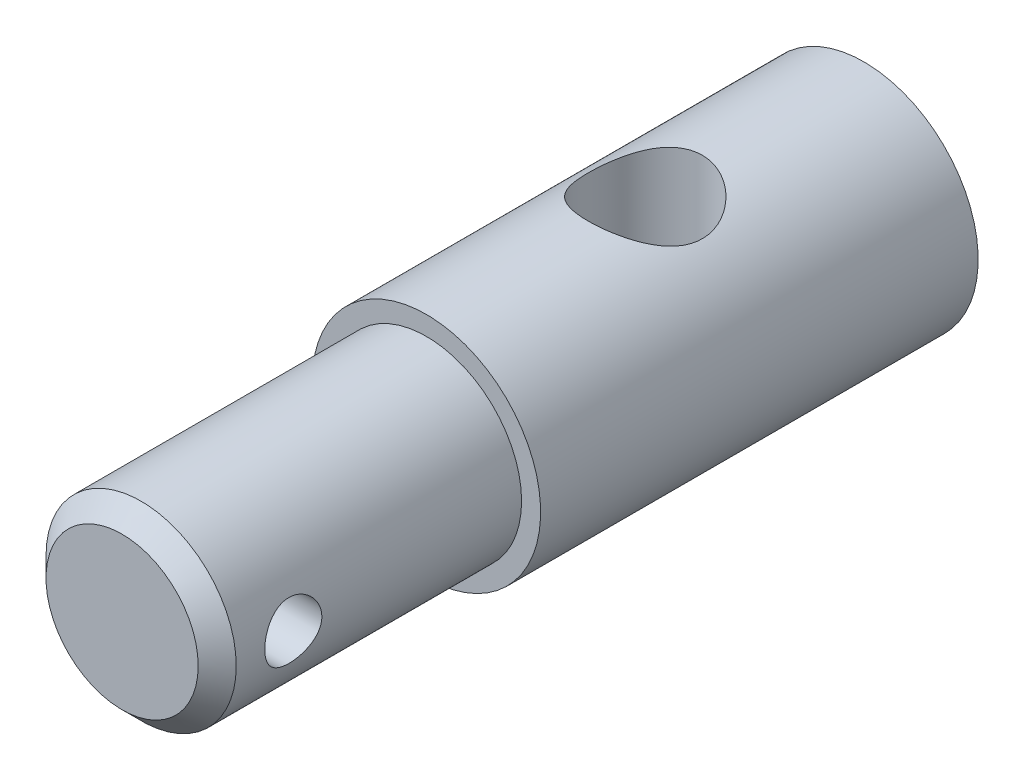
ISO-10303-21;
HEADER;
FILE_DESCRIPTION(('STEP AP214'),'2;1');
FILE_NAME('part.step','',(''),(''),'','','');
FILE_SCHEMA(('AUTOMOTIVE_DESIGN { 1 0 10303 214 1 1 1 1 }'));
ENDSEC;
DATA;
#1=APPLICATION_CONTEXT('core data for automotive mechanical design processes');
#2=APPLICATION_PROTOCOL_DEFINITION('international standard','automotive_design',2000,#1);
#3=PRODUCT_CONTEXT('',#1,'mechanical');
#4=PRODUCT('Part','Part','',(#3));
#5=PRODUCT_RELATED_PRODUCT_CATEGORY('part','',(#4));
#6=PRODUCT_DEFINITION_FORMATION('','',#4);
#7=PRODUCT_DEFINITION_CONTEXT('part definition',#1,'design');
#8=PRODUCT_DEFINITION('design','',#6,#7);
#9=PRODUCT_DEFINITION_SHAPE('','',#8);
#10=(LENGTH_UNIT() NAMED_UNIT(*) SI_UNIT(.MILLI.,.METRE.));
#11=(NAMED_UNIT(*) PLANE_ANGLE_UNIT() SI_UNIT($,.RADIAN.));
#12=(NAMED_UNIT(*) SI_UNIT($,.STERADIAN.) SOLID_ANGLE_UNIT());
#13=UNCERTAINTY_MEASURE_WITH_UNIT(LENGTH_MEASURE(1.E-05),#10,'distance_accuracy_value','');
#14=(GEOMETRIC_REPRESENTATION_CONTEXT(3) GLOBAL_UNCERTAINTY_ASSIGNED_CONTEXT((#13)) GLOBAL_UNIT_ASSIGNED_CONTEXT((#10,
#11,#12)) REPRESENTATION_CONTEXT('',''));
#15=CARTESIAN_POINT('',(0.,0.,0.));
#16=DIRECTION('',(0.,0.,1.));
#17=DIRECTION('',(1.,0.,0.));
#18=AXIS2_PLACEMENT_3D('',#15,#16,#17);
#19=CARTESIAN_POINT('',(0.,0.,-16.));
#20=DIRECTION('',(0.,0.,1.));
#21=DIRECTION('',(1.,0.,0.));
#22=AXIS2_PLACEMENT_3D('',#19,#20,#21);
#23=CYLINDRICAL_SURFACE('',#22,5.);
#24=CARTESIAN_POINT('',(0.,0.,-1.));
#25=DIRECTION('',(0.,0.,1.));
#26=DIRECTION('',(1.,0.,0.));
#27=AXIS2_PLACEMENT_3D('',#24,#25,#26);
#28=CIRCLE('',#27,5.);
#29=CARTESIAN_POINT('',(5.,0.,-1.));
#30=VERTEX_POINT('',#29);
#31=EDGE_CURVE('E10',#30,#30,#28,.F.);
#32=ORIENTED_EDGE('',*,*,#31,.T.);
#33=EDGE_LOOP('',(#32));
#34=FACE_BOUND('',#33,.T.);
#35=CARTESIAN_POINT('',(5.,0.,-5.5));
#36=CARTESIAN_POINT('',(4.9999992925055,0.0822886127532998,-5.49999900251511));
#37=CARTESIAN_POINT('',(4.99794915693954,0.164587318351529,-5.49320613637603));
#38=CARTESIAN_POINT('',(4.98997105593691,0.32678812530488,-5.4662786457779));
#39=CARTESIAN_POINT('',(4.98404193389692,0.406689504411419,-5.44614004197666));
#40=CARTESIAN_POINT('',(4.96895552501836,0.561732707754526,-5.39325398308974));
#41=CARTESIAN_POINT('',(4.95980300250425,0.636881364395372,-5.36052513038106));
#42=CARTESIAN_POINT('',(4.93922109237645,0.78062418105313,-5.28346390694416));
#43=CARTESIAN_POINT('',(4.92779140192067,0.849217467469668,-5.23912999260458));
#44=CARTESIAN_POINT('',(4.90350737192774,0.979871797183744,-5.13877599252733));
#45=CARTESIAN_POINT('',(4.89062383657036,1.04171807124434,-5.08248337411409));
#46=CARTESIAN_POINT('',(4.86505834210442,1.15524920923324,-4.96039077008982));
#47=CARTESIAN_POINT('',(4.85237641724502,1.20693236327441,-4.89458918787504));
#48=CARTESIAN_POINT('',(4.82834113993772,1.29980037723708,-4.75352924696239));
#49=CARTESIAN_POINT('',(4.81702406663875,1.34072309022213,-4.67809153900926));
#50=CARTESIAN_POINT('',(4.79743620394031,1.4092139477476,-4.52101074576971));
#51=CARTESIAN_POINT('',(4.78916468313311,1.43678529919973,-4.43936915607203));
#52=CARTESIAN_POINT('',(4.77690870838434,1.47701633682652,-4.27460973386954));
#53=CARTESIAN_POINT('',(4.77281069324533,1.49007196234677,-4.19159725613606));
#54=CARTESIAN_POINT('',(4.76902789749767,1.50213730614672,-4.02446684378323));
#55=CARTESIAN_POINT('',(4.76934204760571,1.50115042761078,-3.94034918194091));
#56=CARTESIAN_POINT('',(4.77424744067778,1.48546977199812,-3.77661609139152));
#57=CARTESIAN_POINT('',(4.77868388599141,1.47127205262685,-3.69694774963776));
#58=CARTESIAN_POINT('',(4.79108356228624,1.43037420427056,-3.54118021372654));
#59=CARTESIAN_POINT('',(4.79904714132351,1.40367284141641,-3.46508137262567));
#60=CARTESIAN_POINT('',(4.81772733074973,1.33816026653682,-3.31739965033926));
#61=CARTESIAN_POINT('',(4.82848016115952,1.29918816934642,-3.24589291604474));
#62=CARTESIAN_POINT('',(4.85150987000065,1.21035222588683,-3.11026797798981));
#63=CARTESIAN_POINT('',(4.86378711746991,1.16048574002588,-3.04615157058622));
#64=CARTESIAN_POINT('',(4.88911011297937,1.04881290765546,-2.92431380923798));
#65=CARTESIAN_POINT('',(4.90216654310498,0.986594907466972,-2.86697133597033));
#66=CARTESIAN_POINT('',(4.92712244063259,0.853263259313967,-2.76344601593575));
#67=CARTESIAN_POINT('',(4.9390218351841,0.782149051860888,-2.71726387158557));
#68=CARTESIAN_POINT('',(4.96043160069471,0.632355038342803,-2.63714007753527));
#69=CARTESIAN_POINT('',(4.96992543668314,0.553627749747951,-2.60328248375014));
#70=CARTESIAN_POINT('',(4.98533521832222,0.39124541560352,-2.54940040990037));
#71=CARTESIAN_POINT('',(4.99125216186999,0.307591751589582,-2.52937207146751));
#72=CARTESIAN_POINT('',(4.99868364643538,0.140952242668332,-2.50434782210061));
#73=CARTESIAN_POINT('',(5.0003485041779,0.0580500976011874,-2.49883841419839));
#74=CARTESIAN_POINT('',(4.9995292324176,-0.107499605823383,-2.50156915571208));
#75=CARTESIAN_POINT('',(4.99704565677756,-0.19014719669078,-2.50980746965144));
#76=CARTESIAN_POINT('',(4.98830696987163,-0.350903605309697,-2.5393846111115));
#77=CARTESIAN_POINT('',(4.98213829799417,-0.429072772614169,-2.56042338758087));
#78=CARTESIAN_POINT('',(4.96674347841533,-0.580754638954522,-2.6146432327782));
#79=CARTESIAN_POINT('',(4.95751696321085,-0.654266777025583,-2.64782576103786));
#80=CARTESIAN_POINT('',(4.93669654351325,-0.796437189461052,-2.72625316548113));
#81=CARTESIAN_POINT('',(4.92505280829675,-0.864943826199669,-2.77175934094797));
#82=CARTESIAN_POINT('',(4.90073468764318,-0.993523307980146,-2.87322475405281));
#83=CARTESIAN_POINT('',(4.8880600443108,-1.05359403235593,-2.92918661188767));
#84=CARTESIAN_POINT('',(4.86253171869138,-1.16585744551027,-3.05238730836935));
#85=CARTESIAN_POINT('',(4.84968825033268,-1.21768481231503,-3.11996187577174));
#86=CARTESIAN_POINT('',(4.82576515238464,-1.30928995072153,-3.26312793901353));
#87=CARTESIAN_POINT('',(4.81468547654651,-1.34906803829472,-3.33871922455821));
#88=CARTESIAN_POINT('',(4.79567189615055,-1.41517347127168,-3.49553249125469));
#89=CARTESIAN_POINT('',(4.78772337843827,-1.4415634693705,-3.57672618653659));
#90=CARTESIAN_POINT('',(4.77591594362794,-1.48021730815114,-3.74268796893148));
#91=CARTESIAN_POINT('',(4.772055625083,-1.49248598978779,-3.82745482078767));
#92=CARTESIAN_POINT('',(4.76899972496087,-1.50221984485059,-3.99436151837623));
#93=CARTESIAN_POINT('',(4.76961647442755,-1.5002805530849,-4.07646365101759));
#94=CARTESIAN_POINT('',(4.77499401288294,-1.48307505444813,-4.2391141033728));
#95=CARTESIAN_POINT('',(4.77975463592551,-1.46780938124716,-4.31966248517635));
#96=CARTESIAN_POINT('',(4.79275763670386,-1.42476888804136,-4.47594539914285));
#97=CARTESIAN_POINT('',(4.80095604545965,-1.39715175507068,-4.55172728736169));
#98=CARTESIAN_POINT('',(4.81990278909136,-1.33031507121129,-4.69764243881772));
#99=CARTESIAN_POINT('',(4.83065161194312,-1.29109329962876,-4.76777461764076));
#100=CARTESIAN_POINT('',(4.85397676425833,-1.20048763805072,-4.90316311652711));
#101=CARTESIAN_POINT('',(4.86660540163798,-1.14871276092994,-4.96814876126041));
#102=CARTESIAN_POINT('',(4.89201320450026,-1.03517434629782,-5.08870249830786));
#103=CARTESIAN_POINT('',(4.90479240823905,-0.9734082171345,-5.14426813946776));
#104=CARTESIAN_POINT('',(4.92950936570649,-0.839465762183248,-5.24602341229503));
#105=CARTESIAN_POINT('',(4.94141159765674,-0.767037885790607,-5.29189144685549));
#106=CARTESIAN_POINT('',(4.96260680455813,-0.615141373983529,-5.37073516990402));
#107=CARTESIAN_POINT('',(4.97190099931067,-0.535676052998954,-5.40371688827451));
#108=CARTESIAN_POINT('',(4.98602174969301,-0.380757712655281,-5.45289527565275));
#109=CARTESIAN_POINT('',(4.99122027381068,-0.305786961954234,-5.47051167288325));
#110=CARTESIAN_POINT('',(4.99820944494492,-0.153880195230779,-5.49406352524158));
#111=CARTESIAN_POINT('',(5.0000006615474,-0.0769445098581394,-5.50000093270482));
#112=CARTESIAN_POINT('',(5.,0.,-5.5));
#113=B_SPLINE_CURVE_WITH_KNOTS('',3,(#35,#36,#37,#38,#39,#40,#41,#42,#43,#44,#45,#46,#47,#48,
#49,#50,#51,#52,#53,#54,#55,#56,#57,#58,#59,#60,#61,#62,#63,#64,#65,#66,#67,#68,#69,#70,#71,#72,
#73,#74,#75,#76,#77,#78,#79,#80,#81,#82,#83,#84,#85,#86,#87,#88,#89,#90,#91,#92,#93,#94,#95,#96,
#97,#98,#99,#100,#101,#102,#103,#104,#105,#106,#107,#108,#109,#110,#111,#112),.UNSPECIFIED.,.T.,
.F.,(4,2,2,2,2,2,2,2,2,2,2,2,2,2,2,2,2,2,2,2,2,2,2,2,2,2,2,2,2,2,2,2,2,2,2,2,2,2,4),(0.,
0.24658320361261,0.493239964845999,0.739533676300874,0.985860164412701,1.23855602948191,
1.49129437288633,1.74971481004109,2.00807314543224,2.25919689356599,2.51025978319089,
2.75226016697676,2.99428443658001,3.23962426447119,3.48502360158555,3.74067104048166,
3.99633456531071,4.25371046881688,4.51101453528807,4.75908809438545,5.00712853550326,
5.24956746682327,5.49203554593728,5.74011305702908,5.98825282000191,6.24540400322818,
6.5025484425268,6.75847814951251,7.01432009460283,7.25950155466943,7.504673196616,
7.74680040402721,7.98897397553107,8.23996925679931,8.49102974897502,8.7494299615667,
9.00770911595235,9.23831691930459,9.46888616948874),.UNSPECIFIED.);
#114=CARTESIAN_POINT('',(5.,0.,-5.5));
#115=VERTEX_POINT('',#114);
#116=EDGE_CURVE('E46',#115,#115,#113,.T.);
#117=ORIENTED_EDGE('',*,*,#116,.F.);
#118=EDGE_LOOP('',(#117));
#119=FACE_BOUND('',#118,.T.);
#120=CARTESIAN_POINT('',(-5.,0.,-5.5));
#121=CARTESIAN_POINT('',(-4.9999992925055,-0.0822886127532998,-5.49999900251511));
#122=CARTESIAN_POINT('',(-4.99794915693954,-0.164587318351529,-5.49320613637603));
#123=CARTESIAN_POINT('',(-4.98997105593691,-0.32678812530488,-5.4662786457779));
#124=CARTESIAN_POINT('',(-4.98404193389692,-0.406689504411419,-5.44614004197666));
#125=CARTESIAN_POINT('',(-4.96895552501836,-0.561732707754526,-5.39325398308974));
#126=CARTESIAN_POINT('',(-4.95980300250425,-0.636881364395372,-5.36052513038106));
#127=CARTESIAN_POINT('',(-4.93922109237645,-0.78062418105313,-5.28346390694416));
#128=CARTESIAN_POINT('',(-4.92779140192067,-0.849217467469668,-5.23912999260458));
#129=CARTESIAN_POINT('',(-4.90350737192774,-0.979871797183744,-5.13877599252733));
#130=CARTESIAN_POINT('',(-4.89062383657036,-1.04171807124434,-5.08248337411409));
#131=CARTESIAN_POINT('',(-4.86505834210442,-1.15524920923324,-4.96039077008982));
#132=CARTESIAN_POINT('',(-4.85237641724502,-1.20693236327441,-4.89458918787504));
#133=CARTESIAN_POINT('',(-4.82834113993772,-1.29980037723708,-4.75352924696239));
#134=CARTESIAN_POINT('',(-4.81702406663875,-1.34072309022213,-4.67809153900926));
#135=CARTESIAN_POINT('',(-4.79743620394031,-1.4092139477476,-4.52101074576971));
#136=CARTESIAN_POINT('',(-4.78916468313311,-1.43678529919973,-4.43936915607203));
#137=CARTESIAN_POINT('',(-4.77690870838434,-1.47701633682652,-4.27460973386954));
#138=CARTESIAN_POINT('',(-4.77281069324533,-1.49007196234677,-4.19159725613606));
#139=CARTESIAN_POINT('',(-4.76902789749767,-1.50213730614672,-4.02446684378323));
#140=CARTESIAN_POINT('',(-4.76934204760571,-1.50115042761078,-3.94034918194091));
#141=CARTESIAN_POINT('',(-4.77424744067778,-1.48546977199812,-3.77661609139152));
#142=CARTESIAN_POINT('',(-4.77868388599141,-1.47127205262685,-3.69694774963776));
#143=CARTESIAN_POINT('',(-4.79108356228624,-1.43037420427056,-3.54118021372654));
#144=CARTESIAN_POINT('',(-4.79904714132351,-1.40367284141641,-3.46508137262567));
#145=CARTESIAN_POINT('',(-4.81772733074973,-1.33816026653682,-3.31739965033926));
#146=CARTESIAN_POINT('',(-4.82848016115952,-1.29918816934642,-3.24589291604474));
#147=CARTESIAN_POINT('',(-4.85150987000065,-1.21035222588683,-3.11026797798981));
#148=CARTESIAN_POINT('',(-4.86378711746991,-1.16048574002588,-3.04615157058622));
#149=CARTESIAN_POINT('',(-4.88911011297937,-1.04881290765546,-2.92431380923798));
#150=CARTESIAN_POINT('',(-4.90216654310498,-0.986594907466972,-2.86697133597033));
#151=CARTESIAN_POINT('',(-4.92712244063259,-0.853263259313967,-2.76344601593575));
#152=CARTESIAN_POINT('',(-4.9390218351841,-0.782149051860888,-2.71726387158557));
#153=CARTESIAN_POINT('',(-4.96043160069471,-0.632355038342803,-2.63714007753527));
#154=CARTESIAN_POINT('',(-4.96992543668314,-0.553627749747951,-2.60328248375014));
#155=CARTESIAN_POINT('',(-4.98533521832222,-0.39124541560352,-2.54940040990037));
#156=CARTESIAN_POINT('',(-4.99125216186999,-0.307591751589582,-2.52937207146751));
#157=CARTESIAN_POINT('',(-4.99868364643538,-0.140952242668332,-2.50434782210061));
#158=CARTESIAN_POINT('',(-5.0003485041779,-0.0580500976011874,-2.49883841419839));
#159=CARTESIAN_POINT('',(-4.9995292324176,0.107499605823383,-2.50156915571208));
#160=CARTESIAN_POINT('',(-4.99704565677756,0.19014719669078,-2.50980746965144));
#161=CARTESIAN_POINT('',(-4.98830696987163,0.350903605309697,-2.5393846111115));
#162=CARTESIAN_POINT('',(-4.98213829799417,0.429072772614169,-2.56042338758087));
#163=CARTESIAN_POINT('',(-4.96674347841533,0.580754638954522,-2.6146432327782));
#164=CARTESIAN_POINT('',(-4.95751696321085,0.654266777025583,-2.64782576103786));
#165=CARTESIAN_POINT('',(-4.93669654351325,0.796437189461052,-2.72625316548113));
#166=CARTESIAN_POINT('',(-4.92505280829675,0.864943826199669,-2.77175934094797));
#167=CARTESIAN_POINT('',(-4.90073468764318,0.993523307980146,-2.87322475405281));
#168=CARTESIAN_POINT('',(-4.8880600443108,1.05359403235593,-2.92918661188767));
#169=CARTESIAN_POINT('',(-4.86253171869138,1.16585744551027,-3.05238730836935));
#170=CARTESIAN_POINT('',(-4.84968825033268,1.21768481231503,-3.11996187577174));
#171=CARTESIAN_POINT('',(-4.82576515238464,1.30928995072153,-3.26312793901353));
#172=CARTESIAN_POINT('',(-4.81468547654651,1.34906803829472,-3.33871922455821));
#173=CARTESIAN_POINT('',(-4.79567189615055,1.41517347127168,-3.49553249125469));
#174=CARTESIAN_POINT('',(-4.78772337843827,1.4415634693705,-3.57672618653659));
#175=CARTESIAN_POINT('',(-4.77591594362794,1.48021730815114,-3.74268796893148));
#176=CARTESIAN_POINT('',(-4.772055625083,1.49248598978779,-3.82745482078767));
#177=CARTESIAN_POINT('',(-4.76899972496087,1.50221984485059,-3.99436151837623));
#178=CARTESIAN_POINT('',(-4.76961647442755,1.5002805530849,-4.07646365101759));
#179=CARTESIAN_POINT('',(-4.77499401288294,1.48307505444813,-4.2391141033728));
#180=CARTESIAN_POINT('',(-4.77975463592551,1.46780938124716,-4.31966248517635));
#181=CARTESIAN_POINT('',(-4.79275763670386,1.42476888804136,-4.47594539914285));
#182=CARTESIAN_POINT('',(-4.80095604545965,1.39715175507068,-4.55172728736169));
#183=CARTESIAN_POINT('',(-4.81990278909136,1.33031507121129,-4.69764243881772));
#184=CARTESIAN_POINT('',(-4.83065161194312,1.29109329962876,-4.76777461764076));
#185=CARTESIAN_POINT('',(-4.85397676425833,1.20048763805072,-4.90316311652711));
#186=CARTESIAN_POINT('',(-4.86660540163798,1.14871276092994,-4.96814876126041));
#187=CARTESIAN_POINT('',(-4.89201320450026,1.03517434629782,-5.08870249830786));
#188=CARTESIAN_POINT('',(-4.90479240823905,0.9734082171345,-5.14426813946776));
#189=CARTESIAN_POINT('',(-4.92950936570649,0.839465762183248,-5.24602341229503));
#190=CARTESIAN_POINT('',(-4.94141159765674,0.767037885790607,-5.29189144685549));
#191=CARTESIAN_POINT('',(-4.96260680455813,0.615141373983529,-5.37073516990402));
#192=CARTESIAN_POINT('',(-4.97190099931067,0.535676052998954,-5.40371688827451));
#193=CARTESIAN_POINT('',(-4.98602174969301,0.380757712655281,-5.45289527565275));
#194=CARTESIAN_POINT('',(-4.99122027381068,0.305786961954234,-5.47051167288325));
#195=CARTESIAN_POINT('',(-4.99820944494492,0.153880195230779,-5.49406352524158));
#196=CARTESIAN_POINT('',(-5.0000006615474,0.0769445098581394,-5.50000093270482));
#197=CARTESIAN_POINT('',(-5.,0.,-5.5));
#198=B_SPLINE_CURVE_WITH_KNOTS('',3,(#120,#121,#122,#123,#124,#125,#126,#127,#128,#129,#130,
#131,#132,#133,#134,#135,#136,#137,#138,#139,#140,#141,#142,#143,#144,#145,#146,#147,#148,#149,
#150,#151,#152,#153,#154,#155,#156,#157,#158,#159,#160,#161,#162,#163,#164,#165,#166,#167,#168,
#169,#170,#171,#172,#173,#174,#175,#176,#177,#178,#179,#180,#181,#182,#183,#184,#185,#186,#187,
#188,#189,#190,#191,#192,#193,#194,#195,#196,#197),.UNSPECIFIED.,.T.,.F.,(4,2,2,2,2,2,2,2,2,2,2,
2,2,2,2,2,2,2,2,2,2,2,2,2,2,2,2,2,2,2,2,2,2,2,2,2,2,2,4),(0.,0.24658320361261,0.493239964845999,
0.739533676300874,0.985860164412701,1.23855602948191,1.49129437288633,1.74971481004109,
2.00807314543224,2.25919689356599,2.51025978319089,2.75226016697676,2.99428443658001,
3.23962426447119,3.48502360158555,3.74067104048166,3.99633456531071,4.25371046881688,
4.51101453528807,4.75908809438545,5.00712853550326,5.24956746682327,5.49203554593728,
5.74011305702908,5.98825282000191,6.24540400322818,6.5025484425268,6.75847814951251,
7.01432009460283,7.25950155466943,7.504673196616,7.74680040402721,7.98897397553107,
8.23996925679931,8.49102974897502,8.7494299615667,9.00770911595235,9.23831691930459,
9.46888616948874),.UNSPECIFIED.);
#199=CARTESIAN_POINT('',(-5.,0.,-5.5));
#200=VERTEX_POINT('',#199);
#201=EDGE_CURVE('E53',#200,#200,#198,.T.);
#202=ORIENTED_EDGE('',*,*,#201,.F.);
#203=EDGE_LOOP('',(#202));
#204=FACE_BOUND('',#203,.T.);
#205=CARTESIAN_POINT('',(0.,0.,-16.));
#206=DIRECTION('',(0.,0.,-1.));
#207=DIRECTION('',(-1.,0.,0.));
#208=AXIS2_PLACEMENT_3D('',#205,#206,#207);
#209=CIRCLE('',#208,5.);
#210=CARTESIAN_POINT('',(-5.,0.,-16.));
#211=VERTEX_POINT('',#210);
#212=EDGE_CURVE('E39',#211,#211,#209,.F.);
#213=ORIENTED_EDGE('',*,*,#212,.T.);
#214=EDGE_LOOP('',(#213));
#215=FACE_BOUND('',#214,.T.);
#216=ADVANCED_FACE('F28',(#34,#119,#204,#215),#23,.T.);
#217=CARTESIAN_POINT('',(0.,0.,0.));
#218=DIRECTION('',(0.,0.,1.));
#219=DIRECTION('',(1.,0.,0.));
#220=AXIS2_PLACEMENT_3D('',#217,#218,#219);
#221=PLANE('',#220);
#222=CARTESIAN_POINT('',(0.,0.,0.));
#223=DIRECTION('',(0.,0.,1.));
#224=DIRECTION('',(1.,0.,0.));
#225=AXIS2_PLACEMENT_3D('',#222,#223,#224);
#226=CIRCLE('',#225,4.00000000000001);
#227=CARTESIAN_POINT('',(4.00000000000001,0.,0.));
#228=VERTEX_POINT('',#227);
#229=EDGE_CURVE('E35',#228,#228,#226,.T.);
#230=ORIENTED_EDGE('',*,*,#229,.T.);
#231=EDGE_LOOP('',(#230));
#232=FACE_BOUND('',#231,.T.);
#233=ADVANCED_FACE('F86',(#232),#221,.T.);
#234=CARTESIAN_POINT('',(0.,0.,-39.));
#235=DIRECTION('',(0.,0.,1.));
#236=DIRECTION('',(1.,0.,0.));
#237=AXIS2_PLACEMENT_3D('',#234,#235,#236);
#238=CYLINDRICAL_SURFACE('',#237,6.);
#239=CARTESIAN_POINT('',(0.,-6.,-24.5));
#240=CARTESIAN_POINT('',(0.0788941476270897,-5.99999934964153,-24.5000008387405));
#241=CARTESIAN_POINT('',(0.15779662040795,-5.99843869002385,-24.5031179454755));
#242=CARTESIAN_POINT('',(0.315001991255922,-5.99224358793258,-24.51553927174));
#243=CARTESIAN_POINT('',(0.393304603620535,-5.98760776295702,-24.5248462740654));
#244=CARTESIAN_POINT('',(0.626628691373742,-5.96921978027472,-24.5619578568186));
#245=CARTESIAN_POINT('',(0.779952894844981,-5.95098734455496,-24.5989528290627));
#246=CARTESIAN_POINT('',(1.07683586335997,-5.90448966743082,-24.6955817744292));
#247=CARTESIAN_POINT('',(1.22043005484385,-5.87626344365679,-24.7551277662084));
#248=CARTESIAN_POINT('',(1.49540820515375,-5.81237302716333,-24.8947112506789));
#249=CARTESIAN_POINT('',(1.62679312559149,-5.77670942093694,-24.9747471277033));
#250=CARTESIAN_POINT('',(1.88252701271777,-5.69868752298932,-25.1585539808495));
#251=CARTESIAN_POINT('',(2.0059694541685,-5.65605474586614,-25.2634679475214));
#252=CARTESIAN_POINT('',(2.23433451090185,-5.56980033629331,-25.4915559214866));
#253=CARTESIAN_POINT('',(2.3392430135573,-5.5261779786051,-25.6147437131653));
#254=CARTESIAN_POINT('',(2.53576864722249,-5.43896347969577,-25.8874843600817));
#255=CARTESIAN_POINT('',(2.62572411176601,-5.39563602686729,-26.0383409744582));
#256=CARTESIAN_POINT('',(2.7403403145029,-5.33782449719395,-26.2759508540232));
#257=CARTESIAN_POINT('',(2.77516786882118,-5.31974570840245,-26.3570709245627));
#258=CARTESIAN_POINT('',(2.83769299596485,-5.28665768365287,-26.5226005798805));
#259=CARTESIAN_POINT('',(2.86539478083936,-5.27164663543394,-26.6070081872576));
#260=CARTESIAN_POINT('',(2.91188280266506,-5.24610341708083,-26.7733957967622));
#261=CARTESIAN_POINT('',(2.93110042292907,-5.23535838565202,-26.8552227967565));
#262=CARTESIAN_POINT('',(2.9626355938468,-5.21757784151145,-27.0205549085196));
#263=CARTESIAN_POINT('',(2.97495680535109,-5.21054036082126,-27.1040591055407));
#264=CARTESIAN_POINT('',(2.99251382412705,-5.20047756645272,-27.2720063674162));
#265=CARTESIAN_POINT('',(2.99775389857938,-5.19744983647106,-27.3564488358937));
#266=CARTESIAN_POINT('',(3.00108452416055,-5.19552555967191,-27.5254936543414));
#267=CARTESIAN_POINT('',(2.9991757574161,-5.19662861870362,-27.6100959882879));
#268=CARTESIAN_POINT('',(2.98404973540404,-5.20534668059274,-27.8427538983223));
#269=CARTESIAN_POINT('',(2.96335042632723,-5.21726794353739,-27.9902441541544));
#270=CARTESIAN_POINT('',(2.90082280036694,-5.25228182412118,-28.2791936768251));
#271=CARTESIAN_POINT('',(2.85898775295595,-5.2753780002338,-28.4206510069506));
#272=CARTESIAN_POINT('',(2.75462843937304,-5.33062568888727,-28.6976796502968));
#273=CARTESIAN_POINT('',(2.69164495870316,-5.36297559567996,-28.8330371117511));
#274=CARTESIAN_POINT('',(2.54712530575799,-5.43310175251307,-29.091904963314));
#275=CARTESIAN_POINT('',(2.46558080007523,-5.47088043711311,-29.2154099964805));
#276=CARTESIAN_POINT('',(2.27419808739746,-5.55339485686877,-29.4635630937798));
#277=CARTESIAN_POINT('',(2.16208335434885,-5.59840533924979,-29.5863704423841));
#278=CARTESIAN_POINT('',(1.91866675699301,-5.6864286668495,-29.8122064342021));
#279=CARTESIAN_POINT('',(1.78735577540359,-5.72944054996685,-29.9152256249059));
#280=CARTESIAN_POINT('',(1.50154951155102,-5.81105962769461,-30.1030569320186));
#281=CARTESIAN_POINT('',(1.3462607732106,-5.84936952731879,-30.1868014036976));
#282=CARTESIAN_POINT('',(1.02139864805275,-5.91473643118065,-30.3262911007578));
#283=CARTESIAN_POINT('',(0.851836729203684,-5.94180236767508,-30.3820585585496));
#284=CARTESIAN_POINT('',(0.518299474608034,-5.97973001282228,-30.4594262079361));
#285=CARTESIAN_POINT('',(0.355024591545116,-5.99174814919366,-30.4834737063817));
#286=CARTESIAN_POINT('',(0.0263387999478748,-6.00219040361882,-30.5043941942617));
#287=CARTESIAN_POINT('',(-0.139071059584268,-6.00062096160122,-30.5012800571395));
#288=CARTESIAN_POINT('',(-0.453698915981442,-5.98473576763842,-30.4693799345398));
#289=CARTESIAN_POINT('',(-0.603178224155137,-5.97141737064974,-30.4426024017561));
#290=CARTESIAN_POINT('',(-0.895220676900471,-5.93466513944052,-30.3672857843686));
#291=CARTESIAN_POINT('',(-1.03778305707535,-5.91123019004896,-30.3187443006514));
#292=CARTESIAN_POINT('',(-1.31666582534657,-5.85552754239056,-30.2000046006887));
#293=CARTESIAN_POINT('',(-1.45269119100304,-5.82302645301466,-30.1292268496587));
#294=CARTESIAN_POINT('',(-1.71138408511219,-5.75231922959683,-29.9686773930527));
#295=CARTESIAN_POINT('',(-1.83404588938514,-5.71411066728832,-29.8788975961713));
#296=CARTESIAN_POINT('',(-2.07530306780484,-5.63124663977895,-29.6727187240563));
#297=CARTESIAN_POINT('',(-2.19231623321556,-5.58632654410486,-29.5545713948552));
#298=CARTESIAN_POINT('',(-2.40556896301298,-5.49787174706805,-29.3002245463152));
#299=CARTESIAN_POINT('',(-2.50179415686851,-5.4543380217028,-29.1640126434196));
#300=CARTESIAN_POINT('',(-2.675123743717,-5.3715357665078,-28.8690690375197));
#301=CARTESIAN_POINT('',(-2.75107648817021,-5.33257588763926,-28.7095662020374));
#302=CARTESIAN_POINT('',(-2.87424847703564,-5.26722216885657,-28.3774697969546));
#303=CARTESIAN_POINT('',(-2.92150474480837,-5.24081214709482,-28.2048934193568));
#304=CARTESIAN_POINT('',(-2.98158506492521,-5.2068450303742,-27.8692693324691));
#305=CARTESIAN_POINT('',(-2.997278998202,-5.19772150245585,-27.7068972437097));
#306=CARTESIAN_POINT('',(-3.00206745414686,-5.19496064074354,-27.3816587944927));
#307=CARTESIAN_POINT('',(-2.99117350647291,-5.20131659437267,-27.2187926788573));
#308=CARTESIAN_POINT('',(-2.94577840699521,-5.227135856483,-26.9135495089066));
#309=CARTESIAN_POINT('',(-2.91362505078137,-5.24529281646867,-26.7706986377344));
#310=CARTESIAN_POINT('',(-2.82952596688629,-5.29113050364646,-26.4925755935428));
#311=CARTESIAN_POINT('',(-2.77757387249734,-5.3188142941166,-26.357305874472));
#312=CARTESIAN_POINT('',(-2.65144766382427,-5.38285583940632,-26.0881256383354));
#313=CARTESIAN_POINT('',(-2.57601505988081,-5.41967139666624,-25.9549170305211));
#314=CARTESIAN_POINT('',(-2.40645126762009,-5.49706022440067,-25.7021756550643));
#315=CARTESIAN_POINT('',(-2.31231035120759,-5.53763544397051,-25.5826500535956));
#316=CARTESIAN_POINT('',(-2.094616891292,-5.62386853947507,-25.3455771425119));
#317=CARTESIAN_POINT('',(-1.96888052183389,-5.66954494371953,-25.2300348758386));
#318=CARTESIAN_POINT('',(-1.69843715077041,-5.75633712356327,-25.021198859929));
#319=CARTESIAN_POINT('',(-1.55371998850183,-5.79745043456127,-24.9279171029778));
#320=CARTESIAN_POINT('',(-1.32452333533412,-5.85251406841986,-24.8068218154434));
#321=CARTESIAN_POINT('',(-1.24575314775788,-5.86982524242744,-24.7694797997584));
#322=CARTESIAN_POINT('',(-1.08479725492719,-5.90168845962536,-24.7016383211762));
#323=CARTESIAN_POINT('',(-1.00261324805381,-5.91624185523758,-24.6711355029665));
#324=CARTESIAN_POINT('',(-0.835616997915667,-5.94212690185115,-24.6173927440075));
#325=CARTESIAN_POINT('',(-0.750810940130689,-5.95346557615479,-24.594136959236));
#326=CARTESIAN_POINT('',(-0.579142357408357,-5.97260771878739,-24.5551174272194));
#327=CARTESIAN_POINT('',(-0.492281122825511,-5.98041334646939,-24.5393491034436));
#328=CARTESIAN_POINT('',(-0.337824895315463,-5.99085829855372,-24.5183153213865));
#329=CARTESIAN_POINT('',(-0.270495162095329,-5.99428035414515,-24.511453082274));
#330=CARTESIAN_POINT('',(-0.135445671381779,-5.99885151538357,-24.5022949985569));
#331=CARTESIAN_POINT('',(-0.0677259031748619,-6.00000055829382,-24.4999992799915));
#332=CARTESIAN_POINT('',(0.,-6.,-24.5));
#333=B_SPLINE_CURVE_WITH_KNOTS('',3,(#239,#240,#241,#242,#243,#244,#245,#246,#247,#248,#249,
#250,#251,#252,#253,#254,#255,#256,#257,#258,#259,#260,#261,#262,#263,#264,#265,#266,#267,#268,
#269,#270,#271,#272,#273,#274,#275,#276,#277,#278,#279,#280,#281,#282,#283,#284,#285,#286,#287,
#288,#289,#290,#291,#292,#293,#294,#295,#296,#297,#298,#299,#300,#301,#302,#303,#304,#305,#306,
#307,#308,#309,#310,#311,#312,#313,#314,#315,#316,#317,#318,#319,#320,#321,#322,#323,#324,#325,
#326,#327,#328,#329,#330,#331,#332),.UNSPECIFIED.,.T.,.F.,(4,2,2,2,2,2,2,2,2,2,2,2,2,2,2,2,2,2,
2,2,2,2,2,2,2,2,2,2,2,2,2,2,2,2,2,2,2,2,2,2,2,2,2,2,2,2,4),(0.,0.236611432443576,
0.4733293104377,0.947100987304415,1.41904300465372,1.89094781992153,2.39140181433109,
2.89223525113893,3.43190833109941,3.70192714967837,3.97178599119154,4.2256372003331,
4.47935352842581,4.73291689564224,4.98645606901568,5.4323867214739,5.87845946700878,
6.33492255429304,6.79159098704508,7.30616358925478,7.82098138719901,8.35970601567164,
8.89800185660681,9.39171406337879,9.8851922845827,10.3404225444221,10.7957029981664,
11.2640010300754,11.7324988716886,12.2470036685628,12.7618630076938,13.3016558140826,
13.8407507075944,14.3280945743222,14.8152271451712,15.2559532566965,15.6968212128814,
16.1673090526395,16.6380421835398,17.1659726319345,17.6941868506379,17.9605054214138,
18.2266930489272,18.4922945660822,18.7577335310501,18.9608446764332,19.1639614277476),.UNSPECIFIED.);
#334=CARTESIAN_POINT('',(0.,-6.,-24.5));
#335=VERTEX_POINT('',#334);
#336=EDGE_CURVE('E78',#335,#335,#333,.T.);
#337=ORIENTED_EDGE('',*,*,#336,.T.);
#338=EDGE_LOOP('',(#337));
#339=FACE_BOUND('',#338,.T.);
#340=CARTESIAN_POINT('',(0.,6.,-24.5));
#341=CARTESIAN_POINT('',(-0.0788941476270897,5.99999934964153,-24.5000008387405));
#342=CARTESIAN_POINT('',(-0.15779662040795,5.99843869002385,-24.5031179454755));
#343=CARTESIAN_POINT('',(-0.315001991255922,5.99224358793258,-24.51553927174));
#344=CARTESIAN_POINT('',(-0.393304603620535,5.98760776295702,-24.5248462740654));
#345=CARTESIAN_POINT('',(-0.626628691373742,5.96921978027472,-24.5619578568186));
#346=CARTESIAN_POINT('',(-0.779952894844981,5.95098734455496,-24.5989528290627));
#347=CARTESIAN_POINT('',(-1.07683586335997,5.90448966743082,-24.6955817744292));
#348=CARTESIAN_POINT('',(-1.22043005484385,5.87626344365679,-24.7551277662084));
#349=CARTESIAN_POINT('',(-1.49540820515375,5.81237302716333,-24.8947112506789));
#350=CARTESIAN_POINT('',(-1.62679312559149,5.77670942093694,-24.9747471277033));
#351=CARTESIAN_POINT('',(-1.88252701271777,5.69868752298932,-25.1585539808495));
#352=CARTESIAN_POINT('',(-2.0059694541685,5.65605474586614,-25.2634679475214));
#353=CARTESIAN_POINT('',(-2.23433451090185,5.56980033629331,-25.4915559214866));
#354=CARTESIAN_POINT('',(-2.3392430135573,5.5261779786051,-25.6147437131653));
#355=CARTESIAN_POINT('',(-2.53576864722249,5.43896347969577,-25.8874843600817));
#356=CARTESIAN_POINT('',(-2.62572411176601,5.39563602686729,-26.0383409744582));
#357=CARTESIAN_POINT('',(-2.7403403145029,5.33782449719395,-26.2759508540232));
#358=CARTESIAN_POINT('',(-2.77516786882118,5.31974570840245,-26.3570709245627));
#359=CARTESIAN_POINT('',(-2.83769299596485,5.28665768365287,-26.5226005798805));
#360=CARTESIAN_POINT('',(-2.86539478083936,5.27164663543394,-26.6070081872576));
#361=CARTESIAN_POINT('',(-2.91188280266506,5.24610341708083,-26.7733957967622));
#362=CARTESIAN_POINT('',(-2.93110042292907,5.23535838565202,-26.8552227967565));
#363=CARTESIAN_POINT('',(-2.9626355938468,5.21757784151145,-27.0205549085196));
#364=CARTESIAN_POINT('',(-2.97495680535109,5.21054036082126,-27.1040591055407));
#365=CARTESIAN_POINT('',(-2.99251382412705,5.20047756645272,-27.2720063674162));
#366=CARTESIAN_POINT('',(-2.99775389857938,5.19744983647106,-27.3564488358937));
#367=CARTESIAN_POINT('',(-3.00108452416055,5.19552555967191,-27.5254936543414));
#368=CARTESIAN_POINT('',(-2.9991757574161,5.19662861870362,-27.6100959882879));
#369=CARTESIAN_POINT('',(-2.98404973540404,5.20534668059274,-27.8427538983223));
#370=CARTESIAN_POINT('',(-2.96335042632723,5.21726794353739,-27.9902441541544));
#371=CARTESIAN_POINT('',(-2.90082280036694,5.25228182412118,-28.2791936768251));
#372=CARTESIAN_POINT('',(-2.85898775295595,5.2753780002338,-28.4206510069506));
#373=CARTESIAN_POINT('',(-2.75462843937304,5.33062568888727,-28.6976796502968));
#374=CARTESIAN_POINT('',(-2.69164495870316,5.36297559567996,-28.8330371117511));
#375=CARTESIAN_POINT('',(-2.54712530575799,5.43310175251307,-29.091904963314));
#376=CARTESIAN_POINT('',(-2.46558080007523,5.47088043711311,-29.2154099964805));
#377=CARTESIAN_POINT('',(-2.27419808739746,5.55339485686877,-29.4635630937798));
#378=CARTESIAN_POINT('',(-2.16208335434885,5.59840533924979,-29.5863704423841));
#379=CARTESIAN_POINT('',(-1.91866675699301,5.6864286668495,-29.8122064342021));
#380=CARTESIAN_POINT('',(-1.78735577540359,5.72944054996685,-29.9152256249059));
#381=CARTESIAN_POINT('',(-1.50154951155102,5.81105962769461,-30.1030569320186));
#382=CARTESIAN_POINT('',(-1.3462607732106,5.84936952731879,-30.1868014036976));
#383=CARTESIAN_POINT('',(-1.02139864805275,5.91473643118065,-30.3262911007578));
#384=CARTESIAN_POINT('',(-0.851836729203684,5.94180236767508,-30.3820585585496));
#385=CARTESIAN_POINT('',(-0.518299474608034,5.97973001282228,-30.4594262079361));
#386=CARTESIAN_POINT('',(-0.355024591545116,5.99174814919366,-30.4834737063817));
#387=CARTESIAN_POINT('',(-0.0263387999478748,6.00219040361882,-30.5043941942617));
#388=CARTESIAN_POINT('',(0.139071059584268,6.00062096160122,-30.5012800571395));
#389=CARTESIAN_POINT('',(0.453698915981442,5.98473576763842,-30.4693799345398));
#390=CARTESIAN_POINT('',(0.603178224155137,5.97141737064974,-30.4426024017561));
#391=CARTESIAN_POINT('',(0.895220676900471,5.93466513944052,-30.3672857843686));
#392=CARTESIAN_POINT('',(1.03778305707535,5.91123019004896,-30.3187443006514));
#393=CARTESIAN_POINT('',(1.31666582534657,5.85552754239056,-30.2000046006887));
#394=CARTESIAN_POINT('',(1.45269119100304,5.82302645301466,-30.1292268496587));
#395=CARTESIAN_POINT('',(1.71138408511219,5.75231922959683,-29.9686773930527));
#396=CARTESIAN_POINT('',(1.83404588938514,5.71411066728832,-29.8788975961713));
#397=CARTESIAN_POINT('',(2.07530306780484,5.63124663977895,-29.6727187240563));
#398=CARTESIAN_POINT('',(2.19231623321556,5.58632654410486,-29.5545713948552));
#399=CARTESIAN_POINT('',(2.40556896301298,5.49787174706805,-29.3002245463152));
#400=CARTESIAN_POINT('',(2.50179415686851,5.4543380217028,-29.1640126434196));
#401=CARTESIAN_POINT('',(2.675123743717,5.3715357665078,-28.8690690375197));
#402=CARTESIAN_POINT('',(2.75107648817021,5.33257588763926,-28.7095662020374));
#403=CARTESIAN_POINT('',(2.87424847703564,5.26722216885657,-28.3774697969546));
#404=CARTESIAN_POINT('',(2.92150474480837,5.24081214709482,-28.2048934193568));
#405=CARTESIAN_POINT('',(2.98158506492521,5.2068450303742,-27.8692693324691));
#406=CARTESIAN_POINT('',(2.997278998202,5.19772150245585,-27.7068972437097));
#407=CARTESIAN_POINT('',(3.00206745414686,5.19496064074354,-27.3816587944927));
#408=CARTESIAN_POINT('',(2.99117350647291,5.20131659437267,-27.2187926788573));
#409=CARTESIAN_POINT('',(2.94577840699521,5.227135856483,-26.9135495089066));
#410=CARTESIAN_POINT('',(2.91362505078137,5.24529281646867,-26.7706986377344));
#411=CARTESIAN_POINT('',(2.82952596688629,5.29113050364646,-26.4925755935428));
#412=CARTESIAN_POINT('',(2.77757387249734,5.3188142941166,-26.357305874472));
#413=CARTESIAN_POINT('',(2.65144766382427,5.38285583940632,-26.0881256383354));
#414=CARTESIAN_POINT('',(2.57601505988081,5.41967139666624,-25.9549170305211));
#415=CARTESIAN_POINT('',(2.40645126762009,5.49706022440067,-25.7021756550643));
#416=CARTESIAN_POINT('',(2.31231035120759,5.53763544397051,-25.5826500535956));
#417=CARTESIAN_POINT('',(2.094616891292,5.62386853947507,-25.3455771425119));
#418=CARTESIAN_POINT('',(1.96888052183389,5.66954494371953,-25.2300348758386));
#419=CARTESIAN_POINT('',(1.69843715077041,5.75633712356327,-25.021198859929));
#420=CARTESIAN_POINT('',(1.55371998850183,5.79745043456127,-24.9279171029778));
#421=CARTESIAN_POINT('',(1.32452333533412,5.85251406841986,-24.8068218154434));
#422=CARTESIAN_POINT('',(1.24575314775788,5.86982524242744,-24.7694797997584));
#423=CARTESIAN_POINT('',(1.08479725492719,5.90168845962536,-24.7016383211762));
#424=CARTESIAN_POINT('',(1.00261324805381,5.91624185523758,-24.6711355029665));
#425=CARTESIAN_POINT('',(0.835616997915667,5.94212690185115,-24.6173927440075));
#426=CARTESIAN_POINT('',(0.750810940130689,5.95346557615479,-24.594136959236));
#427=CARTESIAN_POINT('',(0.579142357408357,5.97260771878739,-24.5551174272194));
#428=CARTESIAN_POINT('',(0.492281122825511,5.98041334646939,-24.5393491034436));
#429=CARTESIAN_POINT('',(0.337824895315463,5.99085829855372,-24.5183153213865));
#430=CARTESIAN_POINT('',(0.270495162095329,5.99428035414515,-24.511453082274));
#431=CARTESIAN_POINT('',(0.135445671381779,5.99885151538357,-24.5022949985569));
#432=CARTESIAN_POINT('',(0.0677259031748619,6.00000055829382,-24.4999992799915));
#433=CARTESIAN_POINT('',(0.,6.,-24.5));
#434=B_SPLINE_CURVE_WITH_KNOTS('',3,(#340,#341,#342,#343,#344,#345,#346,#347,#348,#349,#350,
#351,#352,#353,#354,#355,#356,#357,#358,#359,#360,#361,#362,#363,#364,#365,#366,#367,#368,#369,
#370,#371,#372,#373,#374,#375,#376,#377,#378,#379,#380,#381,#382,#383,#384,#385,#386,#387,#388,
#389,#390,#391,#392,#393,#394,#395,#396,#397,#398,#399,#400,#401,#402,#403,#404,#405,#406,#407,
#408,#409,#410,#411,#412,#413,#414,#415,#416,#417,#418,#419,#420,#421,#422,#423,#424,#425,#426,
#427,#428,#429,#430,#431,#432,#433),.UNSPECIFIED.,.T.,.F.,(4,2,2,2,2,2,2,2,2,2,2,2,2,2,2,2,2,2,
2,2,2,2,2,2,2,2,2,2,2,2,2,2,2,2,2,2,2,2,2,2,2,2,2,2,2,2,4),(0.,0.236611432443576,
0.4733293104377,0.947100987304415,1.41904300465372,1.89094781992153,2.39140181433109,
2.89223525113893,3.43190833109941,3.70192714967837,3.97178599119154,4.2256372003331,
4.47935352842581,4.73291689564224,4.98645606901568,5.4323867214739,5.87845946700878,
6.33492255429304,6.79159098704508,7.30616358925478,7.82098138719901,8.35970601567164,
8.89800185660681,9.39171406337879,9.8851922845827,10.3404225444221,10.7957029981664,
11.2640010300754,11.7324988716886,12.2470036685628,12.7618630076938,13.3016558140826,
13.8407507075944,14.3280945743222,14.8152271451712,15.2559532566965,15.6968212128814,
16.1673090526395,16.6380421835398,17.1659726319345,17.6941868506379,17.9605054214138,
18.2266930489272,18.4922945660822,18.7577335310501,18.9608446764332,19.1639614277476),.UNSPECIFIED.);
#435=CARTESIAN_POINT('',(0.,6.,-24.5));
#436=VERTEX_POINT('',#435);
#437=EDGE_CURVE('E52',#436,#436,#434,.T.);
#438=ORIENTED_EDGE('',*,*,#437,.T.);
#439=EDGE_LOOP('',(#438));
#440=FACE_BOUND('',#439,.T.);
#441=CARTESIAN_POINT('',(0.,0.,-39.));
#442=DIRECTION('',(0.,0.,-1.));
#443=DIRECTION('',(-1.,0.,0.));
#444=AXIS2_PLACEMENT_3D('',#441,#442,#443);
#445=CIRCLE('',#444,6.);
#446=CARTESIAN_POINT('',(-6.,0.,-39.));
#447=VERTEX_POINT('',#446);
#448=EDGE_CURVE('E43',#447,#447,#445,.T.);
#449=ORIENTED_EDGE('',*,*,#448,.F.);
#450=EDGE_LOOP('',(#449));
#451=FACE_BOUND('',#450,.T.);
#452=CARTESIAN_POINT('',(0.,0.,-16.));
#453=DIRECTION('',(0.,0.,-1.));
#454=DIRECTION('',(-1.,0.,0.));
#455=AXIS2_PLACEMENT_3D('',#452,#453,#454);
#456=CIRCLE('',#455,6.);
#457=CARTESIAN_POINT('',(-6.,0.,-16.));
#458=VERTEX_POINT('',#457);
#459=EDGE_CURVE('E82',#458,#458,#456,.T.);
#460=ORIENTED_EDGE('',*,*,#459,.T.);
#461=EDGE_LOOP('',(#460));
#462=FACE_BOUND('',#461,.T.);
#463=ADVANCED_FACE('F83',(#339,#440,#451,#462),#238,.T.);
#464=CARTESIAN_POINT('',(0.,0.,-39.));
#465=DIRECTION('',(0.,0.,-1.));
#466=DIRECTION('',(-1.,0.,0.));
#467=AXIS2_PLACEMENT_3D('',#464,#465,#466);
#468=PLANE('',#467);
#469=ORIENTED_EDGE('',*,*,#448,.T.);
#470=EDGE_LOOP('',(#469));
#471=FACE_BOUND('',#470,.T.);
#472=ADVANCED_FACE('F71',(#471),#468,.T.);
#473=CARTESIAN_POINT('',(0.,0.,-16.));
#474=DIRECTION('',(0.,0.,-1.));
#475=DIRECTION('',(-1.,0.,0.));
#476=AXIS2_PLACEMENT_3D('',#473,#474,#475);
#477=PLANE('',#476);
#478=ORIENTED_EDGE('',*,*,#212,.F.);
#479=EDGE_LOOP('',(#478));
#480=FACE_BOUND('',#479,.T.);
#481=ORIENTED_EDGE('',*,*,#459,.F.);
#482=EDGE_LOOP('',(#481));
#483=FACE_BOUND('',#482,.T.);
#484=ADVANCED_FACE('F69',(#480,#483),#477,.F.);
#485=CARTESIAN_POINT('',(0.,-11.5,-27.5));
#486=DIRECTION('',(0.,1.,0.));
#487=DIRECTION('',(0.,0.,1.));
#488=AXIS2_PLACEMENT_3D('',#485,#486,#487);
#489=CYLINDRICAL_SURFACE('',#488,3.);
#490=ORIENTED_EDGE('',*,*,#437,.F.);
#491=EDGE_LOOP('',(#490));
#492=FACE_BOUND('',#491,.T.);
#493=ORIENTED_EDGE('',*,*,#336,.F.);
#494=EDGE_LOOP('',(#493));
#495=FACE_BOUND('',#494,.T.);
#496=ADVANCED_FACE('F63',(#492,#495),#489,.F.);
#497=CARTESIAN_POINT('',(-11.5,0.,-4.));
#498=DIRECTION('',(1.,0.,0.));
#499=DIRECTION('',(0.,0.,-1.));
#500=AXIS2_PLACEMENT_3D('',#497,#498,#499);
#501=CYLINDRICAL_SURFACE('',#500,1.5);
#502=ORIENTED_EDGE('',*,*,#116,.T.);
#503=EDGE_LOOP('',(#502));
#504=FACE_BOUND('',#503,.T.);
#505=ORIENTED_EDGE('',*,*,#201,.T.);
#506=EDGE_LOOP('',(#505));
#507=FACE_BOUND('',#506,.T.);
#508=ADVANCED_FACE('F59',(#504,#507),#501,.F.);
#509=CARTESIAN_POINT('',(0.,0.,0.));
#510=DIRECTION('',(0.,0.,-1.));
#511=DIRECTION('',(-1.,0.,0.));
#512=AXIS2_PLACEMENT_3D('',#509,#510,#511);
#513=CONICAL_SURFACE('',#512,4.00000000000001,0.785398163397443);
#514=ORIENTED_EDGE('',*,*,#31,.F.);
#515=EDGE_LOOP('',(#514));
#516=FACE_BOUND('',#515,.T.);
#517=ORIENTED_EDGE('',*,*,#229,.F.);
#518=EDGE_LOOP('',(#517));
#519=FACE_BOUND('',#518,.T.);
#520=ADVANCED_FACE('F30',(#516,#519),#513,.T.);
#521=CLOSED_SHELL('',(#216,#233,#463,#472,#484,#496,#508,#520));
#522=MANIFOLD_SOLID_BREP('B2',#521);
#523=ADVANCED_BREP_SHAPE_REPRESENTATION('',(#18,#522),#14);
#524=SHAPE_DEFINITION_REPRESENTATION(#9,#523);
ENDSEC;
END-ISO-10303-21;
